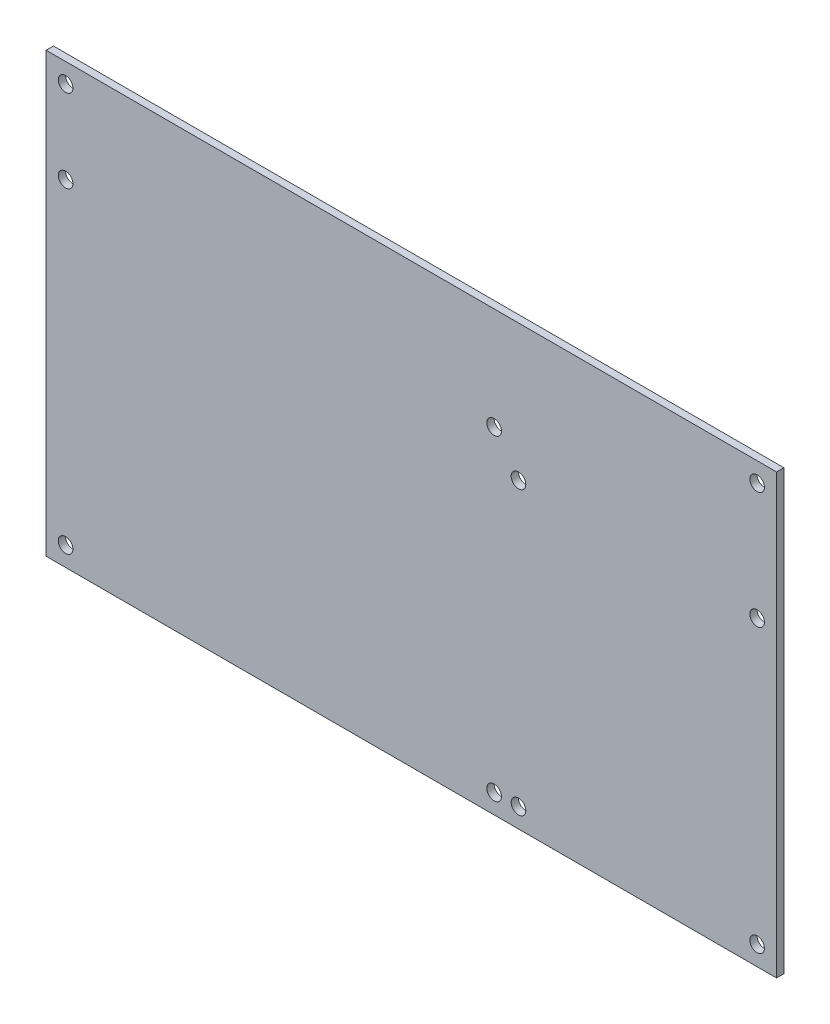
from build123d import *

# Parameters (mm, degrees)
SKIZZE2_W                       = 150
SKIZZE2_H                       = 90
SKIZZE2_R                       = 1.5
AUFSATZ_LINEAR_AUSTRAGEN2_DEPTH = 1.5


with BuildPart() as part:
    # Skizze2 → Aufsatz-Linear austragen2 (new body)
    with BuildSketch(Plane.XY):
        with Locations((75, -45)):
            Rectangle(SKIZZE2_W, SKIZZE2_H)
        with Locations((146, -4)):
            Circle(SKIZZE2_R, mode=Mode.SUBTRACT)
        with Locations((146, -86)):
            Circle(SKIZZE2_R, mode=Mode.SUBTRACT)
        with Locations(Location((4, -86, 0), (0, 0, 180))):
            Circle(SKIZZE2_R, mode=Mode.SUBTRACT)
        with Locations(Location((4, -4, 0), (0, 0, 180))):
            Circle(SKIZZE2_R, mode=Mode.SUBTRACT)
        with Locations((4, -21)):
            Circle(SKIZZE2_R, mode=Mode.SUBTRACT)
        with Locations((92, -86)):
            Circle(SKIZZE2_R, mode=Mode.SUBTRACT)
        with Locations((92, -21)):
            Circle(SKIZZE2_R, mode=Mode.SUBTRACT)
        with Locations((97, -86)):
            Circle(SKIZZE2_R, mode=Mode.SUBTRACT)
        with Locations((97, -28)):
            Circle(SKIZZE2_R, mode=Mode.SUBTRACT)
        with Locations((146, -28)):
            Circle(SKIZZE2_R, mode=Mode.SUBTRACT)
    extrude(amount=AUFSATZ_LINEAR_AUSTRAGEN2_DEPTH)


solid = part.part
